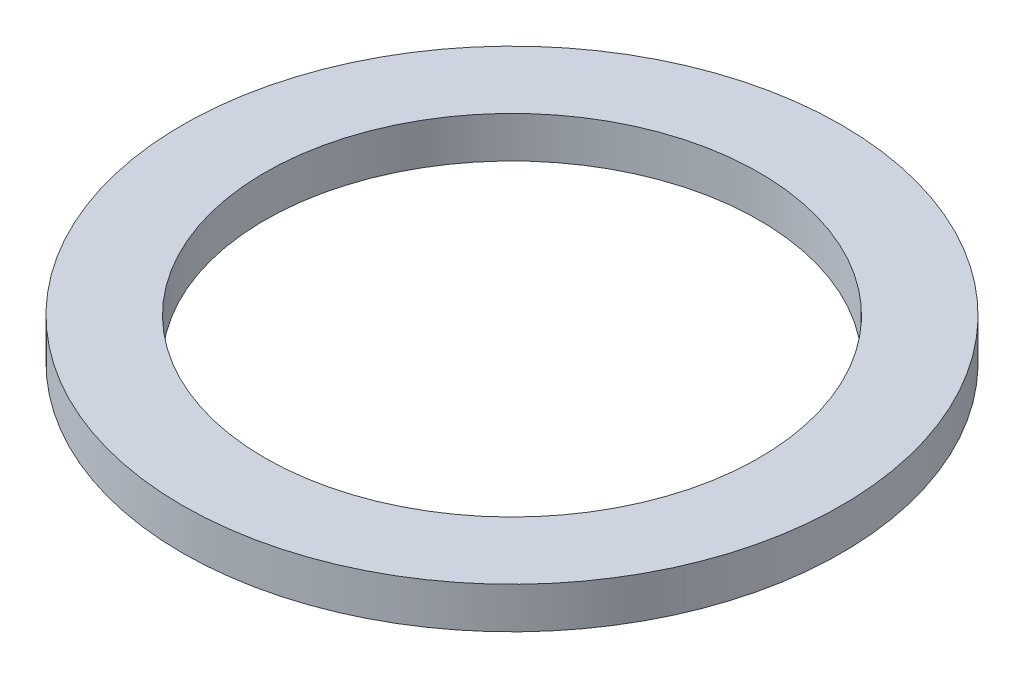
ISO-10303-21;
HEADER;
FILE_DESCRIPTION(('STEP AP214'),'2;1');
FILE_NAME('part.step','',(''),(''),'','','');
FILE_SCHEMA(('AUTOMOTIVE_DESIGN { 1 0 10303 214 1 1 1 1 }'));
ENDSEC;
DATA;
#1=APPLICATION_CONTEXT('core data for automotive mechanical design processes');
#2=APPLICATION_PROTOCOL_DEFINITION('international standard','automotive_design',2000,#1);
#3=PRODUCT_CONTEXT('',#1,'mechanical');
#4=PRODUCT('Part','Part','',(#3));
#5=PRODUCT_RELATED_PRODUCT_CATEGORY('part','',(#4));
#6=PRODUCT_DEFINITION_FORMATION('','',#4);
#7=PRODUCT_DEFINITION_CONTEXT('part definition',#1,'design');
#8=PRODUCT_DEFINITION('design','',#6,#7);
#9=PRODUCT_DEFINITION_SHAPE('','',#8);
#10=(LENGTH_UNIT() NAMED_UNIT(*) SI_UNIT(.MILLI.,.METRE.));
#11=(NAMED_UNIT(*) PLANE_ANGLE_UNIT() SI_UNIT($,.RADIAN.));
#12=(NAMED_UNIT(*) SI_UNIT($,.STERADIAN.) SOLID_ANGLE_UNIT());
#13=UNCERTAINTY_MEASURE_WITH_UNIT(LENGTH_MEASURE(1.E-05),#10,'distance_accuracy_value','');
#14=(GEOMETRIC_REPRESENTATION_CONTEXT(3) GLOBAL_UNCERTAINTY_ASSIGNED_CONTEXT((#13)) GLOBAL_UNIT_ASSIGNED_CONTEXT((#10,
#11,#12)) REPRESENTATION_CONTEXT('',''));
#15=CARTESIAN_POINT('',(0.,0.,0.));
#16=DIRECTION('',(0.,0.,1.));
#17=DIRECTION('',(1.,0.,0.));
#18=AXIS2_PLACEMENT_3D('',#15,#16,#17);
#19=CARTESIAN_POINT('',(0.,2.,0.));
#20=DIRECTION('',(0.,1.,0.));
#21=DIRECTION('',(0.,0.,1.));
#22=AXIS2_PLACEMENT_3D('',#19,#20,#21);
#23=PLANE('',#22);
#24=CARTESIAN_POINT('',(0.,2.,0.));
#25=DIRECTION('',(0.,1.,0.));
#26=DIRECTION('',(0.,0.,1.));
#27=AXIS2_PLACEMENT_3D('',#24,#25,#26);
#28=CIRCLE('',#27,16.);
#29=CARTESIAN_POINT('',(0.,2.,16.));
#30=VERTEX_POINT('',#29);
#31=EDGE_CURVE('E10',#30,#30,#28,.T.);
#32=ORIENTED_EDGE('',*,*,#31,.T.);
#33=EDGE_LOOP('',(#32));
#34=FACE_BOUND('',#33,.T.);
#35=CARTESIAN_POINT('',(0.,2.,0.));
#36=DIRECTION('',(0.,1.,0.));
#37=DIRECTION('',(0.,0.,1.));
#38=AXIS2_PLACEMENT_3D('',#35,#36,#37);
#39=CIRCLE('',#38,12.);
#40=CARTESIAN_POINT('',(0.,2.,12.));
#41=VERTEX_POINT('',#40);
#42=EDGE_CURVE('E35',#41,#41,#39,.T.);
#43=ORIENTED_EDGE('',*,*,#42,.F.);
#44=EDGE_LOOP('',(#43));
#45=FACE_BOUND('',#44,.T.);
#46=ADVANCED_FACE('F24',(#34,#45),#23,.T.);
#47=CARTESIAN_POINT('',(0.,0.,0.));
#48=DIRECTION('',(0.,1.,0.));
#49=DIRECTION('',(0.,0.,1.));
#50=AXIS2_PLACEMENT_3D('',#47,#48,#49);
#51=PLANE('',#50);
#52=CARTESIAN_POINT('',(0.,0.,0.));
#53=DIRECTION('',(0.,1.,0.));
#54=DIRECTION('',(0.,0.,1.));
#55=AXIS2_PLACEMENT_3D('',#52,#53,#54);
#56=CIRCLE('',#55,16.);
#57=CARTESIAN_POINT('',(0.,0.,16.));
#58=VERTEX_POINT('',#57);
#59=EDGE_CURVE('E31',#58,#58,#56,.T.);
#60=ORIENTED_EDGE('',*,*,#59,.F.);
#61=EDGE_LOOP('',(#60));
#62=FACE_BOUND('',#61,.T.);
#63=CARTESIAN_POINT('',(0.,0.,0.));
#64=DIRECTION('',(0.,1.,0.));
#65=DIRECTION('',(0.,0.,1.));
#66=AXIS2_PLACEMENT_3D('',#63,#64,#65);
#67=CIRCLE('',#66,12.);
#68=CARTESIAN_POINT('',(0.,0.,12.));
#69=VERTEX_POINT('',#68);
#70=EDGE_CURVE('E39',#69,#69,#67,.T.);
#71=ORIENTED_EDGE('',*,*,#70,.T.);
#72=EDGE_LOOP('',(#71));
#73=FACE_BOUND('',#72,.T.);
#74=ADVANCED_FACE('F45',(#62,#73),#51,.F.);
#75=CARTESIAN_POINT('',(0.,2.,0.));
#76=DIRECTION('',(0.,-1.,0.));
#77=DIRECTION('',(0.,0.,-1.));
#78=AXIS2_PLACEMENT_3D('',#75,#76,#77);
#79=CYLINDRICAL_SURFACE('',#78,16.);
#80=ORIENTED_EDGE('',*,*,#31,.F.);
#81=EDGE_LOOP('',(#80));
#82=FACE_BOUND('',#81,.T.);
#83=ORIENTED_EDGE('',*,*,#59,.T.);
#84=EDGE_LOOP('',(#83));
#85=FACE_BOUND('',#84,.T.);
#86=ADVANCED_FACE('F26',(#82,#85),#79,.T.);
#87=CARTESIAN_POINT('',(0.,2.,0.));
#88=DIRECTION('',(0.,-1.,0.));
#89=DIRECTION('',(0.,0.,-1.));
#90=AXIS2_PLACEMENT_3D('',#87,#88,#89);
#91=CYLINDRICAL_SURFACE('',#90,12.);
#92=ORIENTED_EDGE('',*,*,#42,.T.);
#93=EDGE_LOOP('',(#92));
#94=FACE_BOUND('',#93,.T.);
#95=ORIENTED_EDGE('',*,*,#70,.F.);
#96=EDGE_LOOP('',(#95));
#97=FACE_BOUND('',#96,.T.);
#98=ADVANCED_FACE('F47',(#94,#97),#91,.F.);
#99=CLOSED_SHELL('',(#46,#74,#86,#98));
#100=MANIFOLD_SOLID_BREP('B2',#99);
#101=ADVANCED_BREP_SHAPE_REPRESENTATION('',(#18,#100),#14);
#102=SHAPE_DEFINITION_REPRESENTATION(#9,#101);
ENDSEC;
END-ISO-10303-21;
